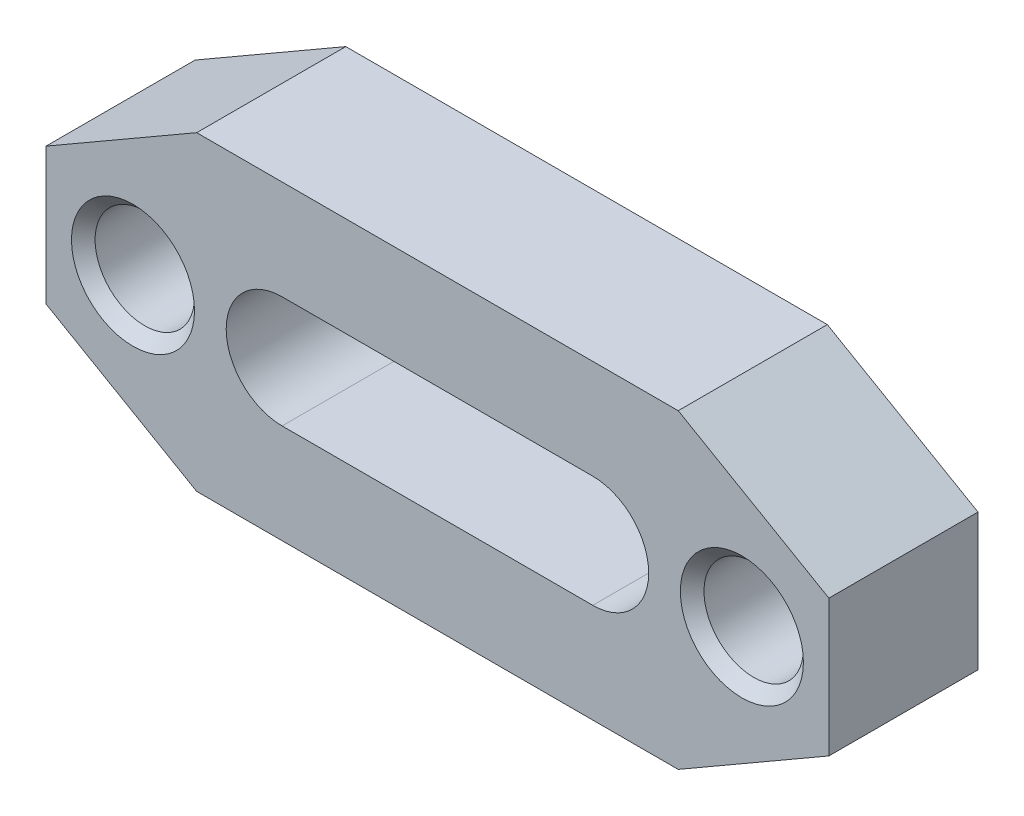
ISO-10303-21;
HEADER;
FILE_DESCRIPTION(('STEP AP214'),'2;1');
FILE_NAME('part.step','',(''),(''),'','','');
FILE_SCHEMA(('AUTOMOTIVE_DESIGN { 1 0 10303 214 1 1 1 1 }'));
ENDSEC;
DATA;
#1=APPLICATION_CONTEXT('core data for automotive mechanical design processes');
#2=APPLICATION_PROTOCOL_DEFINITION('international standard','automotive_design',2000,#1);
#3=PRODUCT_CONTEXT('',#1,'mechanical');
#4=PRODUCT('Part','Part','',(#3));
#5=PRODUCT_RELATED_PRODUCT_CATEGORY('part','',(#4));
#6=PRODUCT_DEFINITION_FORMATION('','',#4);
#7=PRODUCT_DEFINITION_CONTEXT('part definition',#1,'design');
#8=PRODUCT_DEFINITION('design','',#6,#7);
#9=PRODUCT_DEFINITION_SHAPE('','',#8);
#10=(LENGTH_UNIT() NAMED_UNIT(*) SI_UNIT(.MILLI.,.METRE.));
#11=(NAMED_UNIT(*) PLANE_ANGLE_UNIT() SI_UNIT($,.RADIAN.));
#12=(NAMED_UNIT(*) SI_UNIT($,.STERADIAN.) SOLID_ANGLE_UNIT());
#13=UNCERTAINTY_MEASURE_WITH_UNIT(LENGTH_MEASURE(1.E-05),#10,'distance_accuracy_value','');
#14=(GEOMETRIC_REPRESENTATION_CONTEXT(3) GLOBAL_UNCERTAINTY_ASSIGNED_CONTEXT((#13)) GLOBAL_UNIT_ASSIGNED_CONTEXT((#10,
#11,#12)) REPRESENTATION_CONTEXT('',''));
#15=CARTESIAN_POINT('',(0.,0.,0.));
#16=DIRECTION('',(0.,0.,1.));
#17=DIRECTION('',(1.,0.,0.));
#18=AXIS2_PLACEMENT_3D('',#15,#16,#17);
#19=CARTESIAN_POINT('',(31.5,-12.5,12.));
#20=DIRECTION('',(0.,0.,1.));
#21=DIRECTION('',(1.,0.,0.));
#22=AXIS2_PLACEMENT_3D('',#19,#20,#21);
#23=PLANE('',#22);
#24=CARTESIAN_POINT('',(24.5,0.,12.));
#25=DIRECTION('',(0.,0.,-1.));
#26=DIRECTION('',(-1.,0.,0.));
#27=AXIS2_PLACEMENT_3D('',#24,#25,#26);
#28=CIRCLE('',#27,4.95);
#29=CARTESIAN_POINT('',(19.55,0.,12.));
#30=VERTEX_POINT('',#29);
#31=EDGE_CURVE('E212',#30,#30,#28,.T.);
#32=ORIENTED_EDGE('',*,*,#31,.T.);
#33=EDGE_LOOP('',(#32));
#34=FACE_BOUND('',#33,.T.);
#35=CARTESIAN_POINT('',(-24.5,0.,12.));
#36=DIRECTION('',(0.,0.,-1.));
#37=DIRECTION('',(-1.,0.,0.));
#38=AXIS2_PLACEMENT_3D('',#35,#36,#37);
#39=CIRCLE('',#38,4.95);
#40=CARTESIAN_POINT('',(-29.45,0.,12.));
#41=VERTEX_POINT('',#40);
#42=EDGE_CURVE('E133',#41,#41,#39,.T.);
#43=ORIENTED_EDGE('',*,*,#42,.T.);
#44=EDGE_LOOP('',(#43));
#45=FACE_BOUND('',#44,.T.);
#46=DIRECTION('',(1.,0.,0.));
#47=VECTOR('',#46,1.);
#48=CARTESIAN_POINT('',(-19.3756443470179,-12.5,12.));
#49=LINE('',#48,#47);
#50=CARTESIAN_POINT('',(-19.3756443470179,-12.5,12.));
#51=VERTEX_POINT('',#50);
#52=CARTESIAN_POINT('',(19.3756443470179,-12.5,12.));
#53=VERTEX_POINT('',#52);
#54=EDGE_CURVE('E143',#51,#53,#49,.T.);
#55=ORIENTED_EDGE('',*,*,#54,.T.);
#56=DIRECTION('',(0.866025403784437,0.5,0.));
#57=VECTOR('',#56,1.);
#58=CARTESIAN_POINT('',(19.3756443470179,-12.5,12.));
#59=LINE('',#58,#57);
#60=CARTESIAN_POINT('',(31.5,-5.5,12.));
#61=VERTEX_POINT('',#60);
#62=EDGE_CURVE('E146',#53,#61,#59,.T.);
#63=ORIENTED_EDGE('',*,*,#62,.T.);
#64=DIRECTION('',(0.,1.,0.));
#65=VECTOR('',#64,1.);
#66=CARTESIAN_POINT('',(31.5,-5.5,12.));
#67=LINE('',#66,#65);
#68=CARTESIAN_POINT('',(31.5,5.5,12.));
#69=VERTEX_POINT('',#68);
#70=EDGE_CURVE('E149',#61,#69,#67,.T.);
#71=ORIENTED_EDGE('',*,*,#70,.T.);
#72=DIRECTION('',(-0.866025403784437,0.5,0.));
#73=VECTOR('',#72,1.);
#74=CARTESIAN_POINT('',(19.3756443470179,12.5,12.));
#75=LINE('',#74,#73);
#76=CARTESIAN_POINT('',(19.3756443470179,12.5,12.));
#77=VERTEX_POINT('',#76);
#78=EDGE_CURVE('E151',#69,#77,#75,.T.);
#79=ORIENTED_EDGE('',*,*,#78,.T.);
#80=DIRECTION('',(-1.,0.,0.));
#81=VECTOR('',#80,1.);
#82=CARTESIAN_POINT('',(-19.3756443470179,12.5,12.));
#83=LINE('',#82,#81);
#84=CARTESIAN_POINT('',(-19.3756443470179,12.5,12.));
#85=VERTEX_POINT('',#84);
#86=EDGE_CURVE('E153',#77,#85,#83,.T.);
#87=ORIENTED_EDGE('',*,*,#86,.T.);
#88=DIRECTION('',(-0.866025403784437,-0.5,0.));
#89=VECTOR('',#88,1.);
#90=CARTESIAN_POINT('',(-19.3756443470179,12.5,12.));
#91=LINE('',#90,#89);
#92=CARTESIAN_POINT('',(-31.5,5.5,12.));
#93=VERTEX_POINT('',#92);
#94=EDGE_CURVE('E155',#85,#93,#91,.T.);
#95=ORIENTED_EDGE('',*,*,#94,.T.);
#96=DIRECTION('',(0.,-1.,0.));
#97=VECTOR('',#96,1.);
#98=CARTESIAN_POINT('',(-31.5,-5.5,12.));
#99=LINE('',#98,#97);
#100=CARTESIAN_POINT('',(-31.5,-5.5,12.));
#101=VERTEX_POINT('',#100);
#102=EDGE_CURVE('E157',#93,#101,#99,.T.);
#103=ORIENTED_EDGE('',*,*,#102,.T.);
#104=DIRECTION('',(0.866025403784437,-0.5,0.));
#105=VECTOR('',#104,1.);
#106=CARTESIAN_POINT('',(-19.3756443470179,-12.5,12.));
#107=LINE('',#106,#105);
#108=EDGE_CURVE('E159',#101,#51,#107,.T.);
#109=ORIENTED_EDGE('',*,*,#108,.T.);
#110=EDGE_LOOP('',(#55,#63,#71,#79,#87,#95,#103,#109));
#111=FACE_BOUND('',#110,.T.);
#112=DIRECTION('',(-1.,0.,0.));
#113=VECTOR('',#112,1.);
#114=CARTESIAN_POINT('',(12.5,4.5,12.));
#115=LINE('',#114,#113);
#116=CARTESIAN_POINT('',(12.5,4.5,12.));
#117=VERTEX_POINT('',#116);
#118=CARTESIAN_POINT('',(-12.5,4.5,12.));
#119=VERTEX_POINT('',#118);
#120=EDGE_CURVE('E113',#117,#119,#115,.T.);
#121=ORIENTED_EDGE('',*,*,#120,.F.);
#122=CARTESIAN_POINT('',(12.5,0.,12.));
#123=DIRECTION('',(0.,0.,1.));
#124=DIRECTION('',(1.,0.,0.));
#125=AXIS2_PLACEMENT_3D('',#122,#123,#124);
#126=CIRCLE('',#125,4.5);
#127=CARTESIAN_POINT('',(12.5,-4.5,12.));
#128=VERTEX_POINT('',#127);
#129=EDGE_CURVE('E105',#128,#117,#126,.T.);
#130=ORIENTED_EDGE('',*,*,#129,.F.);
#131=DIRECTION('',(1.,0.,0.));
#132=VECTOR('',#131,1.);
#133=CARTESIAN_POINT('',(12.5,-4.5,12.));
#134=LINE('',#133,#132);
#135=CARTESIAN_POINT('',(-12.5,-4.5,12.));
#136=VERTEX_POINT('',#135);
#137=EDGE_CURVE('E127',#136,#128,#134,.T.);
#138=ORIENTED_EDGE('',*,*,#137,.F.);
#139=CARTESIAN_POINT('',(-12.5,0.,12.));
#140=DIRECTION('',(0.,0.,1.));
#141=DIRECTION('',(1.,0.,0.));
#142=AXIS2_PLACEMENT_3D('',#139,#140,#141);
#143=CIRCLE('',#142,4.5);
#144=EDGE_CURVE('E125',#119,#136,#143,.T.);
#145=ORIENTED_EDGE('',*,*,#144,.F.);
#146=EDGE_LOOP('',(#121,#130,#138,#145));
#147=FACE_BOUND('',#146,.T.);
#148=ADVANCED_FACE('F14',(#34,#45,#111,#147),#23,.T.);
#149=CARTESIAN_POINT('',(31.5,-12.5,0.));
#150=DIRECTION('',(0.,0.,1.));
#151=DIRECTION('',(1.,0.,0.));
#152=AXIS2_PLACEMENT_3D('',#149,#150,#151);
#153=PLANE('',#152);
#154=CARTESIAN_POINT('',(24.5,0.,0.));
#155=DIRECTION('',(0.,0.,-1.));
#156=DIRECTION('',(-1.,0.,0.));
#157=AXIS2_PLACEMENT_3D('',#154,#155,#156);
#158=CIRCLE('',#157,4.95);
#159=CARTESIAN_POINT('',(19.55,0.,0.));
#160=VERTEX_POINT('',#159);
#161=EDGE_CURVE('E202',#160,#160,#158,.T.);
#162=ORIENTED_EDGE('',*,*,#161,.F.);
#163=EDGE_LOOP('',(#162));
#164=FACE_BOUND('',#163,.T.);
#165=CARTESIAN_POINT('',(-24.5,0.,0.));
#166=DIRECTION('',(0.,0.,-1.));
#167=DIRECTION('',(-1.,0.,0.));
#168=AXIS2_PLACEMENT_3D('',#165,#166,#167);
#169=CIRCLE('',#168,4.95);
#170=CARTESIAN_POINT('',(-29.45,0.,0.));
#171=VERTEX_POINT('',#170);
#172=EDGE_CURVE('E215',#171,#171,#169,.T.);
#173=ORIENTED_EDGE('',*,*,#172,.F.);
#174=EDGE_LOOP('',(#173));
#175=FACE_BOUND('',#174,.T.);
#176=DIRECTION('',(1.,0.,0.));
#177=VECTOR('',#176,1.);
#178=CARTESIAN_POINT('',(-19.3756443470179,-12.5,0.));
#179=LINE('',#178,#177);
#180=CARTESIAN_POINT('',(-19.3756443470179,-12.5,0.));
#181=VERTEX_POINT('',#180);
#182=CARTESIAN_POINT('',(19.3756443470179,-12.5,0.));
#183=VERTEX_POINT('',#182);
#184=EDGE_CURVE('E121',#181,#183,#179,.T.);
#185=ORIENTED_EDGE('',*,*,#184,.F.);
#186=DIRECTION('',(0.866025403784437,-0.5,0.));
#187=VECTOR('',#186,1.);
#188=CARTESIAN_POINT('',(-19.3756443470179,-12.5,0.));
#189=LINE('',#188,#187);
#190=CARTESIAN_POINT('',(-31.5,-5.5,0.));
#191=VERTEX_POINT('',#190);
#192=EDGE_CURVE('E147',#191,#181,#189,.T.);
#193=ORIENTED_EDGE('',*,*,#192,.F.);
#194=DIRECTION('',(0.,-1.,0.));
#195=VECTOR('',#194,1.);
#196=CARTESIAN_POINT('',(-31.5,-5.5,0.));
#197=LINE('',#196,#195);
#198=CARTESIAN_POINT('',(-31.5,5.5,0.));
#199=VERTEX_POINT('',#198);
#200=EDGE_CURVE('E174',#199,#191,#197,.T.);
#201=ORIENTED_EDGE('',*,*,#200,.F.);
#202=DIRECTION('',(-0.866025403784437,-0.5,0.));
#203=VECTOR('',#202,1.);
#204=CARTESIAN_POINT('',(-19.3756443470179,12.5,0.));
#205=LINE('',#204,#203);
#206=CARTESIAN_POINT('',(-19.3756443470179,12.5,0.));
#207=VERTEX_POINT('',#206);
#208=EDGE_CURVE('E172',#207,#199,#205,.T.);
#209=ORIENTED_EDGE('',*,*,#208,.F.);
#210=DIRECTION('',(-1.,0.,0.));
#211=VECTOR('',#210,1.);
#212=CARTESIAN_POINT('',(-19.3756443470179,12.5,0.));
#213=LINE('',#212,#211);
#214=CARTESIAN_POINT('',(19.3756443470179,12.5,0.));
#215=VERTEX_POINT('',#214);
#216=EDGE_CURVE('E170',#215,#207,#213,.T.);
#217=ORIENTED_EDGE('',*,*,#216,.F.);
#218=DIRECTION('',(-0.866025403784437,0.5,0.));
#219=VECTOR('',#218,1.);
#220=CARTESIAN_POINT('',(19.3756443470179,12.5,0.));
#221=LINE('',#220,#219);
#222=CARTESIAN_POINT('',(31.5,5.5,0.));
#223=VERTEX_POINT('',#222);
#224=EDGE_CURVE('E168',#223,#215,#221,.T.);
#225=ORIENTED_EDGE('',*,*,#224,.F.);
#226=DIRECTION('',(0.,1.,0.));
#227=VECTOR('',#226,1.);
#228=CARTESIAN_POINT('',(31.5,-5.5,0.));
#229=LINE('',#228,#227);
#230=CARTESIAN_POINT('',(31.5,-5.5,0.));
#231=VERTEX_POINT('',#230);
#232=EDGE_CURVE('E166',#231,#223,#229,.T.);
#233=ORIENTED_EDGE('',*,*,#232,.F.);
#234=DIRECTION('',(0.866025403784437,0.5,0.));
#235=VECTOR('',#234,1.);
#236=CARTESIAN_POINT('',(19.3756443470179,-12.5,0.));
#237=LINE('',#236,#235);
#238=EDGE_CURVE('E164',#183,#231,#237,.T.);
#239=ORIENTED_EDGE('',*,*,#238,.F.);
#240=EDGE_LOOP('',(#185,#193,#201,#209,#217,#225,#233,#239));
#241=FACE_BOUND('',#240,.T.);
#242=CARTESIAN_POINT('',(12.5,0.,0.));
#243=DIRECTION('',(0.,0.,1.));
#244=DIRECTION('',(1.,0.,0.));
#245=AXIS2_PLACEMENT_3D('',#242,#243,#244);
#246=CIRCLE('',#245,4.5);
#247=CARTESIAN_POINT('',(12.5,-4.5,0.));
#248=VERTEX_POINT('',#247);
#249=CARTESIAN_POINT('',(12.5,4.5,0.));
#250=VERTEX_POINT('',#249);
#251=EDGE_CURVE('E39',#248,#250,#246,.T.);
#252=ORIENTED_EDGE('',*,*,#251,.T.);
#253=DIRECTION('',(-1.,0.,0.));
#254=VECTOR('',#253,1.);
#255=CARTESIAN_POINT('',(12.5,4.5,0.));
#256=LINE('',#255,#254);
#257=CARTESIAN_POINT('',(-12.5,4.5,0.));
#258=VERTEX_POINT('',#257);
#259=EDGE_CURVE('E120',#250,#258,#256,.T.);
#260=ORIENTED_EDGE('',*,*,#259,.T.);
#261=CARTESIAN_POINT('',(-12.5,0.,0.));
#262=DIRECTION('',(0.,0.,1.));
#263=DIRECTION('',(1.,0.,0.));
#264=AXIS2_PLACEMENT_3D('',#261,#262,#263);
#265=CIRCLE('',#264,4.5);
#266=CARTESIAN_POINT('',(-12.5,-4.5,0.));
#267=VERTEX_POINT('',#266);
#268=EDGE_CURVE('E135',#258,#267,#265,.T.);
#269=ORIENTED_EDGE('',*,*,#268,.T.);
#270=DIRECTION('',(1.,0.,0.));
#271=VECTOR('',#270,1.);
#272=CARTESIAN_POINT('',(12.5,-4.5,0.));
#273=LINE('',#272,#271);
#274=EDGE_CURVE('E114',#267,#248,#273,.T.);
#275=ORIENTED_EDGE('',*,*,#274,.T.);
#276=EDGE_LOOP('',(#252,#260,#269,#275));
#277=FACE_BOUND('',#276,.T.);
#278=ADVANCED_FACE('F238',(#164,#175,#241,#277),#153,.F.);
#279=CARTESIAN_POINT('',(-19.3756443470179,-12.5,12.));
#280=DIRECTION('',(0.,1.,0.));
#281=DIRECTION('',(-1.,0.,0.));
#282=AXIS2_PLACEMENT_3D('',#279,#280,#281);
#283=PLANE('',#282);
#284=ORIENTED_EDGE('',*,*,#184,.T.);
#285=DIRECTION('',(0.,0.,-1.));
#286=VECTOR('',#285,1.);
#287=CARTESIAN_POINT('',(19.3756443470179,-12.5,12.));
#288=LINE('',#287,#286);
#289=EDGE_CURVE('E9',#53,#183,#288,.T.);
#290=ORIENTED_EDGE('',*,*,#289,.F.);
#291=ORIENTED_EDGE('',*,*,#54,.F.);
#292=DIRECTION('',(0.,0.,-1.));
#293=VECTOR('',#292,1.);
#294=CARTESIAN_POINT('',(-19.3756443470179,-12.5,12.));
#295=LINE('',#294,#293);
#296=EDGE_CURVE('E161',#51,#181,#295,.T.);
#297=ORIENTED_EDGE('',*,*,#296,.T.);
#298=EDGE_LOOP('',(#284,#290,#291,#297));
#299=FACE_BOUND('',#298,.T.);
#300=ADVANCED_FACE('F16',(#299),#283,.F.);
#301=CARTESIAN_POINT('',(19.3756443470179,-12.5,12.));
#302=DIRECTION('',(-0.5,0.866025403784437,0.));
#303=DIRECTION('',(-0.866025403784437,-0.5,0.));
#304=AXIS2_PLACEMENT_3D('',#301,#302,#303);
#305=PLANE('',#304);
#306=ORIENTED_EDGE('',*,*,#238,.T.);
#307=DIRECTION('',(0.,0.,-1.));
#308=VECTOR('',#307,1.);
#309=CARTESIAN_POINT('',(31.5,-5.5,12.));
#310=LINE('',#309,#308);
#311=EDGE_CURVE('E23',#61,#231,#310,.T.);
#312=ORIENTED_EDGE('',*,*,#311,.F.);
#313=ORIENTED_EDGE('',*,*,#62,.F.);
#314=ORIENTED_EDGE('',*,*,#289,.T.);
#315=EDGE_LOOP('',(#306,#312,#313,#314));
#316=FACE_BOUND('',#315,.T.);
#317=ADVANCED_FACE('F271',(#316),#305,.F.);
#318=CARTESIAN_POINT('',(31.5,-5.5,12.));
#319=DIRECTION('',(-1.,0.,0.));
#320=DIRECTION('',(0.,0.,1.));
#321=AXIS2_PLACEMENT_3D('',#318,#319,#320);
#322=PLANE('',#321);
#323=ORIENTED_EDGE('',*,*,#232,.T.);
#324=DIRECTION('',(0.,0.,-1.));
#325=VECTOR('',#324,1.);
#326=CARTESIAN_POINT('',(31.5,5.5,12.));
#327=LINE('',#326,#325);
#328=EDGE_CURVE('E191',#69,#223,#327,.T.);
#329=ORIENTED_EDGE('',*,*,#328,.F.);
#330=ORIENTED_EDGE('',*,*,#70,.F.);
#331=ORIENTED_EDGE('',*,*,#311,.T.);
#332=EDGE_LOOP('',(#323,#329,#330,#331));
#333=FACE_BOUND('',#332,.T.);
#334=ADVANCED_FACE('F268',(#333),#322,.F.);
#335=CARTESIAN_POINT('',(19.3756443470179,12.5,12.));
#336=DIRECTION('',(-0.5,-0.866025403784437,0.));
#337=DIRECTION('',(0.866025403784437,-0.5,0.));
#338=AXIS2_PLACEMENT_3D('',#335,#336,#337);
#339=PLANE('',#338);
#340=ORIENTED_EDGE('',*,*,#224,.T.);
#341=DIRECTION('',(0.,0.,-1.));
#342=VECTOR('',#341,1.);
#343=CARTESIAN_POINT('',(19.3756443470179,12.5,12.));
#344=LINE('',#343,#342);
#345=EDGE_CURVE('E188',#77,#215,#344,.T.);
#346=ORIENTED_EDGE('',*,*,#345,.F.);
#347=ORIENTED_EDGE('',*,*,#78,.F.);
#348=ORIENTED_EDGE('',*,*,#328,.T.);
#349=EDGE_LOOP('',(#340,#346,#347,#348));
#350=FACE_BOUND('',#349,.T.);
#351=ADVANCED_FACE('F264',(#350),#339,.F.);
#352=CARTESIAN_POINT('',(-19.3756443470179,12.5,12.));
#353=DIRECTION('',(0.,-1.,0.));
#354=DIRECTION('',(0.,0.,-1.));
#355=AXIS2_PLACEMENT_3D('',#352,#353,#354);
#356=PLANE('',#355);
#357=ORIENTED_EDGE('',*,*,#216,.T.);
#358=DIRECTION('',(0.,0.,-1.));
#359=VECTOR('',#358,1.);
#360=CARTESIAN_POINT('',(-19.3756443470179,12.5,12.));
#361=LINE('',#360,#359);
#362=EDGE_CURVE('E185',#85,#207,#361,.T.);
#363=ORIENTED_EDGE('',*,*,#362,.F.);
#364=ORIENTED_EDGE('',*,*,#86,.F.);
#365=ORIENTED_EDGE('',*,*,#345,.T.);
#366=EDGE_LOOP('',(#357,#363,#364,#365));
#367=FACE_BOUND('',#366,.T.);
#368=ADVANCED_FACE('F260',(#367),#356,.F.);
#369=CARTESIAN_POINT('',(-19.3756443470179,12.5,12.));
#370=DIRECTION('',(0.5,-0.866025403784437,0.));
#371=DIRECTION('',(0.866025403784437,0.5,0.));
#372=AXIS2_PLACEMENT_3D('',#369,#370,#371);
#373=PLANE('',#372);
#374=ORIENTED_EDGE('',*,*,#208,.T.);
#375=DIRECTION('',(0.,0.,-1.));
#376=VECTOR('',#375,1.);
#377=CARTESIAN_POINT('',(-31.5,5.5,12.));
#378=LINE('',#377,#376);
#379=EDGE_CURVE('E182',#93,#199,#378,.T.);
#380=ORIENTED_EDGE('',*,*,#379,.F.);
#381=ORIENTED_EDGE('',*,*,#94,.F.);
#382=ORIENTED_EDGE('',*,*,#362,.T.);
#383=EDGE_LOOP('',(#374,#380,#381,#382));
#384=FACE_BOUND('',#383,.T.);
#385=ADVANCED_FACE('F256',(#384),#373,.F.);
#386=CARTESIAN_POINT('',(-31.5,-5.5,12.));
#387=DIRECTION('',(1.,0.,0.));
#388=DIRECTION('',(0.,0.,-1.));
#389=AXIS2_PLACEMENT_3D('',#386,#387,#388);
#390=PLANE('',#389);
#391=ORIENTED_EDGE('',*,*,#200,.T.);
#392=DIRECTION('',(0.,0.,-1.));
#393=VECTOR('',#392,1.);
#394=CARTESIAN_POINT('',(-31.5,-5.5,12.));
#395=LINE('',#394,#393);
#396=EDGE_CURVE('E179',#101,#191,#395,.T.);
#397=ORIENTED_EDGE('',*,*,#396,.F.);
#398=ORIENTED_EDGE('',*,*,#102,.F.);
#399=ORIENTED_EDGE('',*,*,#379,.T.);
#400=EDGE_LOOP('',(#391,#397,#398,#399));
#401=FACE_BOUND('',#400,.T.);
#402=ADVANCED_FACE('F252',(#401),#390,.F.);
#403=CARTESIAN_POINT('',(-19.3756443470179,-12.5,12.));
#404=DIRECTION('',(0.5,0.866025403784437,0.));
#405=DIRECTION('',(-0.866025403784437,0.5,0.));
#406=AXIS2_PLACEMENT_3D('',#403,#404,#405);
#407=PLANE('',#406);
#408=ORIENTED_EDGE('',*,*,#192,.T.);
#409=ORIENTED_EDGE('',*,*,#296,.F.);
#410=ORIENTED_EDGE('',*,*,#108,.F.);
#411=ORIENTED_EDGE('',*,*,#396,.T.);
#412=EDGE_LOOP('',(#408,#409,#410,#411));
#413=FACE_BOUND('',#412,.T.);
#414=ADVANCED_FACE('F249',(#413),#407,.F.);
#415=CARTESIAN_POINT('',(12.5,0.,12.));
#416=DIRECTION('',(0.,0.,-1.));
#417=DIRECTION('',(-1.,0.,0.));
#418=AXIS2_PLACEMENT_3D('',#415,#416,#417);
#419=CYLINDRICAL_SURFACE('',#418,4.5);
#420=ORIENTED_EDGE('',*,*,#251,.F.);
#421=DIRECTION('',(0.,0.,-1.));
#422=VECTOR('',#421,1.);
#423=CARTESIAN_POINT('',(12.5,-4.5,12.));
#424=LINE('',#423,#422);
#425=EDGE_CURVE('E109',#128,#248,#424,.T.);
#426=ORIENTED_EDGE('',*,*,#425,.F.);
#427=ORIENTED_EDGE('',*,*,#129,.T.);
#428=DIRECTION('',(0.,0.,-1.));
#429=VECTOR('',#428,1.);
#430=CARTESIAN_POINT('',(12.5,4.5,12.));
#431=LINE('',#430,#429);
#432=EDGE_CURVE('E108',#117,#250,#431,.T.);
#433=ORIENTED_EDGE('',*,*,#432,.T.);
#434=EDGE_LOOP('',(#420,#426,#427,#433));
#435=FACE_BOUND('',#434,.T.);
#436=ADVANCED_FACE('F107',(#435),#419,.F.);
#437=CARTESIAN_POINT('',(12.5,4.5,12.));
#438=DIRECTION('',(0.,-1.,0.));
#439=DIRECTION('',(1.,0.,0.));
#440=AXIS2_PLACEMENT_3D('',#437,#438,#439);
#441=PLANE('',#440);
#442=ORIENTED_EDGE('',*,*,#259,.F.);
#443=ORIENTED_EDGE('',*,*,#432,.F.);
#444=ORIENTED_EDGE('',*,*,#120,.T.);
#445=DIRECTION('',(0.,0.,-1.));
#446=VECTOR('',#445,1.);
#447=CARTESIAN_POINT('',(-12.5,4.5,12.));
#448=LINE('',#447,#446);
#449=EDGE_CURVE('E122',#119,#258,#448,.T.);
#450=ORIENTED_EDGE('',*,*,#449,.T.);
#451=EDGE_LOOP('',(#442,#443,#444,#450));
#452=FACE_BOUND('',#451,.T.);
#453=ADVANCED_FACE('F117',(#452),#441,.T.);
#454=CARTESIAN_POINT('',(-12.5,0.,12.));
#455=DIRECTION('',(0.,0.,-1.));
#456=DIRECTION('',(-1.,0.,0.));
#457=AXIS2_PLACEMENT_3D('',#454,#455,#456);
#458=CYLINDRICAL_SURFACE('',#457,4.5);
#459=ORIENTED_EDGE('',*,*,#268,.F.);
#460=ORIENTED_EDGE('',*,*,#449,.F.);
#461=ORIENTED_EDGE('',*,*,#144,.T.);
#462=DIRECTION('',(0.,0.,-1.));
#463=VECTOR('',#462,1.);
#464=CARTESIAN_POINT('',(-12.5,-4.5,12.));
#465=LINE('',#464,#463);
#466=EDGE_CURVE('E31',#136,#267,#465,.T.);
#467=ORIENTED_EDGE('',*,*,#466,.T.);
#468=EDGE_LOOP('',(#459,#460,#461,#467));
#469=FACE_BOUND('',#468,.T.);
#470=ADVANCED_FACE('F235',(#469),#458,.F.);
#471=CARTESIAN_POINT('',(12.5,-4.5,12.));
#472=DIRECTION('',(0.,1.,0.));
#473=DIRECTION('',(-1.,0.,0.));
#474=AXIS2_PLACEMENT_3D('',#471,#472,#473);
#475=PLANE('',#474);
#476=ORIENTED_EDGE('',*,*,#274,.F.);
#477=ORIENTED_EDGE('',*,*,#466,.F.);
#478=ORIENTED_EDGE('',*,*,#137,.T.);
#479=ORIENTED_EDGE('',*,*,#425,.T.);
#480=EDGE_LOOP('',(#476,#477,#478,#479));
#481=FACE_BOUND('',#480,.T.);
#482=ADVANCED_FACE('F225',(#481),#475,.T.);
#483=CARTESIAN_POINT('',(-24.5,0.,10.5));
#484=DIRECTION('',(0.,0.,1.));
#485=DIRECTION('',(1.,0.,0.));
#486=AXIS2_PLACEMENT_3D('',#483,#484,#485);
#487=CONICAL_SURFACE('',#486,3.45,0.785398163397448);
#488=CARTESIAN_POINT('',(-24.5,0.,11.05));
#489=DIRECTION('',(0.,0.,1.));
#490=DIRECTION('',(1.,0.,0.));
#491=AXIS2_PLACEMENT_3D('',#488,#489,#490);
#492=CIRCLE('',#491,4.);
#493=CARTESIAN_POINT('',(-20.5,0.,11.05));
#494=VERTEX_POINT('',#493);
#495=EDGE_CURVE('E197',#494,#494,#492,.F.);
#496=ORIENTED_EDGE('',*,*,#495,.T.);
#497=EDGE_LOOP('',(#496));
#498=FACE_BOUND('',#497,.T.);
#499=ORIENTED_EDGE('',*,*,#42,.F.);
#500=EDGE_LOOP('',(#499));
#501=FACE_BOUND('',#500,.T.);
#502=ADVANCED_FACE('F222',(#498,#501),#487,.F.);
#503=CARTESIAN_POINT('',(-24.5,0.,0.));
#504=DIRECTION('',(0.,0.,-1.));
#505=DIRECTION('',(-1.,0.,0.));
#506=AXIS2_PLACEMENT_3D('',#503,#504,#505);
#507=CONICAL_SURFACE('',#506,4.95,0.785398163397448);
#508=CARTESIAN_POINT('',(-24.5,0.,0.95));
#509=DIRECTION('',(0.,0.,-1.));
#510=DIRECTION('',(-1.,0.,0.));
#511=AXIS2_PLACEMENT_3D('',#508,#509,#510);
#512=CIRCLE('',#511,4.);
#513=CARTESIAN_POINT('',(-28.5,0.,0.95));
#514=VERTEX_POINT('',#513);
#515=EDGE_CURVE('E195',#514,#514,#512,.F.);
#516=ORIENTED_EDGE('',*,*,#515,.T.);
#517=EDGE_LOOP('',(#516));
#518=FACE_BOUND('',#517,.T.);
#519=ORIENTED_EDGE('',*,*,#172,.T.);
#520=EDGE_LOOP('',(#519));
#521=FACE_BOUND('',#520,.T.);
#522=ADVANCED_FACE('F224',(#518,#521),#507,.F.);
#523=CARTESIAN_POINT('',(24.5,0.,10.5));
#524=DIRECTION('',(0.,0.,1.));
#525=DIRECTION('',(1.,0.,0.));
#526=AXIS2_PLACEMENT_3D('',#523,#524,#525);
#527=CONICAL_SURFACE('',#526,3.45,0.785398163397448);
#528=CARTESIAN_POINT('',(24.5,0.,11.05));
#529=DIRECTION('',(0.,0.,1.));
#530=DIRECTION('',(1.,0.,0.));
#531=AXIS2_PLACEMENT_3D('',#528,#529,#530);
#532=CIRCLE('',#531,4.);
#533=CARTESIAN_POINT('',(28.5,0.,11.05));
#534=VERTEX_POINT('',#533);
#535=EDGE_CURVE('E198',#534,#534,#532,.F.);
#536=ORIENTED_EDGE('',*,*,#535,.T.);
#537=EDGE_LOOP('',(#536));
#538=FACE_BOUND('',#537,.T.);
#539=ORIENTED_EDGE('',*,*,#31,.F.);
#540=EDGE_LOOP('',(#539));
#541=FACE_BOUND('',#540,.T.);
#542=ADVANCED_FACE('F233',(#538,#541),#527,.F.);
#543=CARTESIAN_POINT('',(24.5,0.,0.));
#544=DIRECTION('',(0.,0.,-1.));
#545=DIRECTION('',(-1.,0.,0.));
#546=AXIS2_PLACEMENT_3D('',#543,#544,#545);
#547=CONICAL_SURFACE('',#546,4.95,0.785398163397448);
#548=CARTESIAN_POINT('',(24.5,0.,0.95));
#549=DIRECTION('',(0.,0.,-1.));
#550=DIRECTION('',(-1.,0.,0.));
#551=AXIS2_PLACEMENT_3D('',#548,#549,#550);
#552=CIRCLE('',#551,4.);
#553=CARTESIAN_POINT('',(20.5,0.,0.95));
#554=VERTEX_POINT('',#553);
#555=EDGE_CURVE('E18',#554,#554,#552,.F.);
#556=ORIENTED_EDGE('',*,*,#555,.T.);
#557=EDGE_LOOP('',(#556));
#558=FACE_BOUND('',#557,.T.);
#559=ORIENTED_EDGE('',*,*,#161,.T.);
#560=EDGE_LOOP('',(#559));
#561=FACE_BOUND('',#560,.T.);
#562=ADVANCED_FACE('F398',(#558,#561),#547,.F.);
#563=CARTESIAN_POINT('',(-24.5,0.,0.));
#564=DIRECTION('',(0.,0.,1.));
#565=DIRECTION('',(1.,0.,0.));
#566=AXIS2_PLACEMENT_3D('',#563,#564,#565);
#567=CYLINDRICAL_SURFACE('',#566,4.);
#568=ORIENTED_EDGE('',*,*,#515,.F.);
#569=EDGE_LOOP('',(#568));
#570=FACE_BOUND('',#569,.T.);
#571=ORIENTED_EDGE('',*,*,#495,.F.);
#572=EDGE_LOOP('',(#571));
#573=FACE_BOUND('',#572,.T.);
#574=ADVANCED_FACE('F407',(#570,#573),#567,.F.);
#575=CARTESIAN_POINT('',(24.5,0.,0.));
#576=DIRECTION('',(0.,0.,1.));
#577=DIRECTION('',(1.,0.,0.));
#578=AXIS2_PLACEMENT_3D('',#575,#576,#577);
#579=CYLINDRICAL_SURFACE('',#578,4.);
#580=ORIENTED_EDGE('',*,*,#555,.F.);
#581=EDGE_LOOP('',(#580));
#582=FACE_BOUND('',#581,.T.);
#583=ORIENTED_EDGE('',*,*,#535,.F.);
#584=EDGE_LOOP('',(#583));
#585=FACE_BOUND('',#584,.T.);
#586=ADVANCED_FACE('F417',(#582,#585),#579,.F.);
#587=CLOSED_SHELL('',(#148,#278,#300,#317,#334,#351,#368,#385,#402,#414,#436,#453,#470,#482,
#502,#522,#542,#562,#574,#586));
#588=MANIFOLD_SOLID_BREP('B1',#587);
#589=ADVANCED_BREP_SHAPE_REPRESENTATION('',(#18,#588),#14);
#590=SHAPE_DEFINITION_REPRESENTATION(#9,#589);
ENDSEC;
END-ISO-10303-21;
